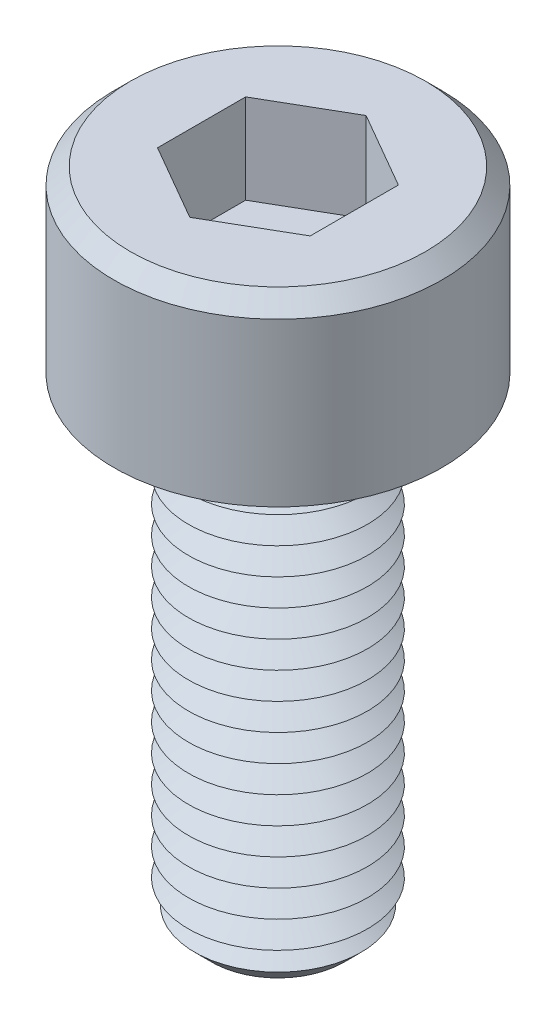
ISO-10303-21;
HEADER;
FILE_DESCRIPTION(('STEP AP214'),'2;1');
FILE_NAME('part.step','',(''),(''),'','','');
FILE_SCHEMA(('AUTOMOTIVE_DESIGN { 1 0 10303 214 1 1 1 1 }'));
ENDSEC;
DATA;
#1=APPLICATION_CONTEXT('core data for automotive mechanical design processes');
#2=APPLICATION_PROTOCOL_DEFINITION('international standard','automotive_design',2000,#1);
#3=PRODUCT_CONTEXT('',#1,'mechanical');
#4=PRODUCT('Part','Part','',(#3));
#5=PRODUCT_RELATED_PRODUCT_CATEGORY('part','',(#4));
#6=PRODUCT_DEFINITION_FORMATION('','',#4);
#7=PRODUCT_DEFINITION_CONTEXT('part definition',#1,'design');
#8=PRODUCT_DEFINITION('design','',#6,#7);
#9=PRODUCT_DEFINITION_SHAPE('','',#8);
#10=(LENGTH_UNIT() NAMED_UNIT(*) SI_UNIT(.MILLI.,.METRE.));
#11=(NAMED_UNIT(*) PLANE_ANGLE_UNIT() SI_UNIT($,.RADIAN.));
#12=(NAMED_UNIT(*) SI_UNIT($,.STERADIAN.) SOLID_ANGLE_UNIT());
#13=UNCERTAINTY_MEASURE_WITH_UNIT(LENGTH_MEASURE(1.E-05),#10,'distance_accuracy_value','');
#14=(GEOMETRIC_REPRESENTATION_CONTEXT(3) GLOBAL_UNCERTAINTY_ASSIGNED_CONTEXT((#13)) GLOBAL_UNIT_ASSIGNED_CONTEXT((#10,
#11,#12)) REPRESENTATION_CONTEXT('',''));
#15=CARTESIAN_POINT('',(0.,0.,0.));
#16=DIRECTION('',(0.,0.,1.));
#17=DIRECTION('',(1.,0.,0.));
#18=AXIS2_PLACEMENT_3D('',#15,#16,#17);
#19=CARTESIAN_POINT('',(0.,0.,0.));
#20=DIRECTION('',(0.,-1.,0.));
#21=DIRECTION('',(0.,0.,-1.00000000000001));
#22=AXIS2_PLACEMENT_3D('',#19,#20,#21);
#23=PLANE('',#22);
#24=CARTESIAN_POINT('',(0.,0.,0.));
#25=DIRECTION('',(0.,-1.,0.));
#26=DIRECTION('',(0.,0.,-1.00000000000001));
#27=AXIS2_PLACEMENT_3D('',#24,#25,#26);
#28=CIRCLE('',#27,1.5);
#29=CARTESIAN_POINT('',(0.,0.,-1.50000000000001));
#30=VERTEX_POINT('',#29);
#31=EDGE_CURVE('E11',#30,#30,#28,.T.);
#32=ORIENTED_EDGE('',*,*,#31,.F.);
#33=EDGE_LOOP('',(#32));
#34=FACE_BOUND('',#33,.T.);
#35=CARTESIAN_POINT('',(0.,0.,0.));
#36=DIRECTION('',(0.,-1.,0.));
#37=DIRECTION('',(0.,0.,-1.00000000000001));
#38=AXIS2_PLACEMENT_3D('',#35,#36,#37);
#39=CIRCLE('',#38,2.75);
#40=CARTESIAN_POINT('',(0.,0.,-2.75000000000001));
#41=VERTEX_POINT('',#40);
#42=EDGE_CURVE('E43',#41,#41,#39,.T.);
#43=ORIENTED_EDGE('',*,*,#42,.T.);
#44=EDGE_LOOP('',(#43));
#45=FACE_BOUND('',#44,.T.);
#46=ADVANCED_FACE('F36',(#34,#45),#23,.T.);
#47=CARTESIAN_POINT('',(0.,0.,0.));
#48=DIRECTION('',(0.,-1.,0.));
#49=DIRECTION('',(0.,0.,-1.00000000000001));
#50=AXIS2_PLACEMENT_3D('',#47,#48,#49);
#51=CYLINDRICAL_SURFACE('',#50,2.75);
#52=CARTESIAN_POINT('',(0.,2.725,0.));
#53=DIRECTION('',(0.,-1.,0.));
#54=DIRECTION('',(0.,0.,-1.00000000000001));
#55=AXIS2_PLACEMENT_3D('',#52,#53,#54);
#56=CIRCLE('',#55,2.75);
#57=CARTESIAN_POINT('',(0.,2.725,-2.75000000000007));
#58=VERTEX_POINT('',#57);
#59=EDGE_CURVE('E253',#58,#58,#56,.T.);
#60=ORIENTED_EDGE('',*,*,#59,.T.);
#61=EDGE_LOOP('',(#60));
#62=FACE_BOUND('',#61,.T.);
#63=ORIENTED_EDGE('',*,*,#42,.F.);
#64=EDGE_LOOP('',(#63));
#65=FACE_BOUND('',#64,.T.);
#66=ADVANCED_FACE('F259',(#62,#65),#51,.T.);
#67=CARTESIAN_POINT('',(0.,2.725,0.));
#68=DIRECTION('',(0.,-1.,0.));
#69=DIRECTION('',(0.,0.,-1.00000000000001));
#70=AXIS2_PLACEMENT_3D('',#67,#68,#69);
#71=CONICAL_SURFACE('',#70,2.75,0.785398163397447);
#72=CARTESIAN_POINT('',(0.,3.,0.));
#73=DIRECTION('',(0.,-1.,0.));
#74=DIRECTION('',(0.,0.,-1.00000000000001));
#75=AXIS2_PLACEMENT_3D('',#72,#73,#74);
#76=CIRCLE('',#75,2.475);
#77=CARTESIAN_POINT('',(0.,3.,-2.47500000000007));
#78=VERTEX_POINT('',#77);
#79=EDGE_CURVE('E250',#78,#78,#76,.T.);
#80=ORIENTED_EDGE('',*,*,#79,.T.);
#81=EDGE_LOOP('',(#80));
#82=FACE_BOUND('',#81,.T.);
#83=ORIENTED_EDGE('',*,*,#59,.F.);
#84=EDGE_LOOP('',(#83));
#85=FACE_BOUND('',#84,.T.);
#86=ADVANCED_FACE('F261',(#82,#85),#71,.T.);
#87=CARTESIAN_POINT('',(2.47500000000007,2.99999999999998,0.));
#88=DIRECTION('',(0.,1.,0.));
#89=DIRECTION('',(0.,0.,1.00000000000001));
#90=AXIS2_PLACEMENT_3D('',#87,#88,#89);
#91=PLANE('',#90);
#92=DIRECTION('',(1.02063357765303E-11,0.,1.00000000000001));
#93=VECTOR('',#92,1.);
#94=CARTESIAN_POINT('',(-1.28000000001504,2.99999999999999,-0.739008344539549));
#95=LINE('',#94,#93);
#96=CARTESIAN_POINT('',(-1.28000000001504,2.99999999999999,-0.739008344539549));
#97=VERTEX_POINT('',#96);
#98=CARTESIAN_POINT('',(-1.27999999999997,3.,0.739008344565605));
#99=VERTEX_POINT('',#98);
#100=EDGE_CURVE('E50',#97,#99,#95,.T.);
#101=ORIENTED_EDGE('',*,*,#100,.F.);
#102=DIRECTION('',(-0.866025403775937,0.,0.500000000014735));
#103=VECTOR('',#102,1.);
#104=CARTESIAN_POINT('',(-2.25930385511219E-11,2.99999999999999,-1.47801668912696));
#105=LINE('',#104,#103);
#106=CARTESIAN_POINT('',(-2.25930385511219E-11,2.99999999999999,-1.47801668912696));
#107=VERTEX_POINT('',#106);
#108=EDGE_CURVE('E133',#107,#97,#105,.T.);
#109=ORIENTED_EDGE('',*,*,#108,.F.);
#110=DIRECTION('',(-0.866025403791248,0.,-0.499999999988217));
#111=VECTOR('',#110,1.);
#112=CARTESIAN_POINT('',(1.27999999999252,3.,-0.73900834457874));
#113=LINE('',#112,#111);
#114=CARTESIAN_POINT('',(1.27999999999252,3.,-0.73900834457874));
#115=VERTEX_POINT('',#114);
#116=EDGE_CURVE('E131',#115,#107,#113,.T.);
#117=ORIENTED_EDGE('',*,*,#116,.F.);
#118=DIRECTION('',(-1.02068770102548E-11,0.,-1.00000000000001));
#119=VECTOR('',#118,1.);
#120=CARTESIAN_POINT('',(1.28000000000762,2.99999999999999,0.739008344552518));
#121=LINE('',#120,#119);
#122=CARTESIAN_POINT('',(1.28000000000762,2.99999999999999,0.739008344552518));
#123=VERTEX_POINT('',#122);
#124=EDGE_CURVE('E98',#123,#115,#121,.T.);
#125=ORIENTED_EDGE('',*,*,#124,.F.);
#126=DIRECTION('',(0.866025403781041,0.,-0.500000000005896));
#127=VECTOR('',#126,1.);
#128=CARTESIAN_POINT('',(7.60155827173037E-12,3.00000000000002,1.47801668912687));
#129=LINE('',#128,#127);
#130=CARTESIAN_POINT('',(7.60155827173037E-12,3.00000000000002,1.47801668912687));
#131=VERTEX_POINT('',#130);
#132=EDGE_CURVE('E127',#131,#123,#129,.T.);
#133=ORIENTED_EDGE('',*,*,#132,.F.);
#134=DIRECTION('',(0.866025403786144,0.,0.499999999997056));
#135=VECTOR('',#134,1.);
#136=CARTESIAN_POINT('',(-1.27999999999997,3.,0.739008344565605));
#137=LINE('',#136,#135);
#138=EDGE_CURVE('E124',#99,#131,#137,.T.);
#139=ORIENTED_EDGE('',*,*,#138,.F.);
#140=EDGE_LOOP('',(#101,#109,#117,#125,#133,#139));
#141=FACE_BOUND('',#140,.T.);
#142=ORIENTED_EDGE('',*,*,#79,.F.);
#143=EDGE_LOOP('',(#142));
#144=FACE_BOUND('',#143,.T.);
#145=ADVANCED_FACE('F267',(#141,#144),#91,.T.);
#146=CARTESIAN_POINT('',(0.,-8.00000000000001,0.));
#147=DIRECTION('',(0.,-1.,0.));
#148=DIRECTION('',(0.,0.,-1.00000000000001));
#149=AXIS2_PLACEMENT_3D('',#146,#147,#148);
#150=PLANE('',#149);
#151=CARTESIAN_POINT('',(0.,-8.00000000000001,0.));
#152=DIRECTION('',(0.,-1.,0.));
#153=DIRECTION('',(0.,0.,-1.00000000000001));
#154=AXIS2_PLACEMENT_3D('',#151,#152,#153);
#155=CIRCLE('',#154,1.1087025);
#156=CARTESIAN_POINT('',(0.,-8.00000000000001,-1.1087025));
#157=VERTEX_POINT('',#156);
#158=EDGE_CURVE('E247',#157,#157,#155,.T.);
#159=ORIENTED_EDGE('',*,*,#158,.T.);
#160=EDGE_LOOP('',(#159));
#161=FACE_BOUND('',#160,.T.);
#162=ADVANCED_FACE('F274',(#161),#150,.T.);
#163=CARTESIAN_POINT('',(0.,-8.00000000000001,0.));
#164=DIRECTION('',(0.,1.,0.));
#165=DIRECTION('',(0.,0.,1.00000000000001));
#166=AXIS2_PLACEMENT_3D('',#163,#164,#165);
#167=CONICAL_SURFACE('',#166,1.1087025,0.785398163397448);
#168=CARTESIAN_POINT('',(0.,-7.71308703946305,0.));
#169=DIRECTION('',(0.,-1.,0.));
#170=DIRECTION('',(0.,0.,-1.00000000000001));
#171=AXIS2_PLACEMENT_3D('',#168,#169,#170);
#172=CIRCLE('',#171,1.39561546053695);
#173=CARTESIAN_POINT('',(0.,-7.71308703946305,-1.39561546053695));
#174=VERTEX_POINT('',#173);
#175=EDGE_CURVE('E244',#174,#174,#172,.T.);
#176=ORIENTED_EDGE('',*,*,#175,.T.);
#177=EDGE_LOOP('',(#176));
#178=FACE_BOUND('',#177,.T.);
#179=ORIENTED_EDGE('',*,*,#158,.F.);
#180=EDGE_LOOP('',(#179));
#181=FACE_BOUND('',#180,.T.);
#182=ADVANCED_FACE('F278',(#178,#181),#167,.T.);
#183=CARTESIAN_POINT('',(0.,-7.71308703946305,0.));
#184=DIRECTION('',(0.,-1.,0.));
#185=DIRECTION('',(0.,0.,-1.00000000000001));
#186=AXIS2_PLACEMENT_3D('',#183,#184,#185);
#187=CONICAL_SURFACE('',#186,1.39561546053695,1.04910999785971);
#188=CARTESIAN_POINT('',(0.,-7.54816856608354,0.));
#189=DIRECTION('',(0.,-1.,0.));
#190=DIRECTION('',(0.,0.,-1.00000000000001));
#191=AXIS2_PLACEMENT_3D('',#188,#189,#190);
#192=CIRCLE('',#191,1.1087025);
#193=CARTESIAN_POINT('',(0.,-7.54816856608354,-1.10870250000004));
#194=VERTEX_POINT('',#193);
#195=EDGE_CURVE('E241',#194,#194,#192,.T.);
#196=ORIENTED_EDGE('',*,*,#195,.T.);
#197=EDGE_LOOP('',(#196));
#198=FACE_BOUND('',#197,.T.);
#199=ORIENTED_EDGE('',*,*,#175,.F.);
#200=EDGE_LOOP('',(#199));
#201=FACE_BOUND('',#200,.T.);
#202=ADVANCED_FACE('F282',(#198,#201),#187,.T.);
#203=CARTESIAN_POINT('',(0.,-7.54816856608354,0.));
#204=DIRECTION('',(0.,1.,0.));
#205=DIRECTION('',(0.,0.,1.00000000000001));
#206=AXIS2_PLACEMENT_3D('',#203,#204,#205);
#207=CONICAL_SURFACE('',#206,1.1087025,1.0471975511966);
#208=CARTESIAN_POINT('',(0.,-7.32225284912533,0.));
#209=DIRECTION('',(0.,-1.,0.));
#210=DIRECTION('',(0.,0.,-1.00000000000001));
#211=AXIS2_PLACEMENT_3D('',#208,#209,#210);
#212=CIRCLE('',#211,1.5);
#213=CARTESIAN_POINT('',(0.,-7.32225284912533,-1.50000000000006));
#214=VERTEX_POINT('',#213);
#215=EDGE_CURVE('E238',#214,#214,#212,.T.);
#216=ORIENTED_EDGE('',*,*,#215,.T.);
#217=EDGE_LOOP('',(#216));
#218=FACE_BOUND('',#217,.T.);
#219=ORIENTED_EDGE('',*,*,#195,.F.);
#220=EDGE_LOOP('',(#219));
#221=FACE_BOUND('',#220,.T.);
#222=ADVANCED_FACE('F286',(#218,#221),#207,.T.);
#223=CARTESIAN_POINT('',(0.,-7.32225284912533,0.));
#224=DIRECTION('',(0.,-1.,0.));
#225=DIRECTION('',(0.,0.,-1.00000000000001));
#226=AXIS2_PLACEMENT_3D('',#223,#224,#225);
#227=CONICAL_SURFACE('',#226,1.5,1.0471975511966);
#228=CARTESIAN_POINT('',(0.,-7.09633713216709,0.));
#229=DIRECTION('',(0.,-1.,0.));
#230=DIRECTION('',(0.,0.,-1.00000000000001));
#231=AXIS2_PLACEMENT_3D('',#228,#229,#230);
#232=CIRCLE('',#231,1.1087025);
#233=CARTESIAN_POINT('',(0.,-7.09633713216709,-1.10870250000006));
#234=VERTEX_POINT('',#233);
#235=EDGE_CURVE('E235',#234,#234,#232,.T.);
#236=ORIENTED_EDGE('',*,*,#235,.T.);
#237=EDGE_LOOP('',(#236));
#238=FACE_BOUND('',#237,.T.);
#239=ORIENTED_EDGE('',*,*,#215,.F.);
#240=EDGE_LOOP('',(#239));
#241=FACE_BOUND('',#240,.T.);
#242=ADVANCED_FACE('F290',(#238,#241),#227,.T.);
#243=CARTESIAN_POINT('',(0.,-7.09633713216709,0.));
#244=DIRECTION('',(0.,1.,0.));
#245=DIRECTION('',(0.,0.,1.00000000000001));
#246=AXIS2_PLACEMENT_3D('',#243,#244,#245);
#247=CONICAL_SURFACE('',#246,1.1087025,1.0471975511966);
#248=CARTESIAN_POINT('',(0.,-6.87042141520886,0.));
#249=DIRECTION('',(0.,-1.,0.));
#250=DIRECTION('',(0.,0.,-1.00000000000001));
#251=AXIS2_PLACEMENT_3D('',#248,#249,#250);
#252=CIRCLE('',#251,1.5);
#253=CARTESIAN_POINT('',(0.,-6.87042141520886,-1.50000000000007));
#254=VERTEX_POINT('',#253);
#255=EDGE_CURVE('E232',#254,#254,#252,.T.);
#256=ORIENTED_EDGE('',*,*,#255,.T.);
#257=EDGE_LOOP('',(#256));
#258=FACE_BOUND('',#257,.T.);
#259=ORIENTED_EDGE('',*,*,#235,.F.);
#260=EDGE_LOOP('',(#259));
#261=FACE_BOUND('',#260,.T.);
#262=ADVANCED_FACE('F294',(#258,#261),#247,.T.);
#263=CARTESIAN_POINT('',(0.,-6.87042141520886,0.));
#264=DIRECTION('',(0.,-1.,0.));
#265=DIRECTION('',(0.,0.,-1.00000000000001));
#266=AXIS2_PLACEMENT_3D('',#263,#264,#265);
#267=CONICAL_SURFACE('',#266,1.5,1.0471975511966);
#268=CARTESIAN_POINT('',(0.,-6.64450569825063,0.));
#269=DIRECTION('',(0.,-1.,0.));
#270=DIRECTION('',(0.,0.,-1.00000000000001));
#271=AXIS2_PLACEMENT_3D('',#268,#269,#270);
#272=CIRCLE('',#271,1.1087025);
#273=CARTESIAN_POINT('',(0.,-6.64450569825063,-1.10870250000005));
#274=VERTEX_POINT('',#273);
#275=EDGE_CURVE('E229',#274,#274,#272,.T.);
#276=ORIENTED_EDGE('',*,*,#275,.T.);
#277=EDGE_LOOP('',(#276));
#278=FACE_BOUND('',#277,.T.);
#279=ORIENTED_EDGE('',*,*,#255,.F.);
#280=EDGE_LOOP('',(#279));
#281=FACE_BOUND('',#280,.T.);
#282=ADVANCED_FACE('F298',(#278,#281),#267,.T.);
#283=CARTESIAN_POINT('',(0.,-6.64450569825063,0.));
#284=DIRECTION('',(0.,1.,0.));
#285=DIRECTION('',(0.,0.,1.00000000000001));
#286=AXIS2_PLACEMENT_3D('',#283,#284,#285);
#287=CONICAL_SURFACE('',#286,1.1087025,1.0471975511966);
#288=CARTESIAN_POINT('',(0.,-6.41858998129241,0.));
#289=DIRECTION('',(0.,-1.,0.));
#290=DIRECTION('',(0.,0.,-1.00000000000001));
#291=AXIS2_PLACEMENT_3D('',#288,#289,#290);
#292=CIRCLE('',#291,1.5);
#293=CARTESIAN_POINT('',(0.,-6.41858998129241,-1.50000000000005));
#294=VERTEX_POINT('',#293);
#295=EDGE_CURVE('E226',#294,#294,#292,.T.);
#296=ORIENTED_EDGE('',*,*,#295,.T.);
#297=EDGE_LOOP('',(#296));
#298=FACE_BOUND('',#297,.T.);
#299=ORIENTED_EDGE('',*,*,#275,.F.);
#300=EDGE_LOOP('',(#299));
#301=FACE_BOUND('',#300,.T.);
#302=ADVANCED_FACE('F302',(#298,#301),#287,.T.);
#303=CARTESIAN_POINT('',(0.,-6.41858998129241,0.));
#304=DIRECTION('',(0.,-1.,0.));
#305=DIRECTION('',(0.,0.,-1.00000000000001));
#306=AXIS2_PLACEMENT_3D('',#303,#304,#305);
#307=CONICAL_SURFACE('',#306,1.5,1.0471975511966);
#308=CARTESIAN_POINT('',(0.,-6.19267426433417,0.));
#309=DIRECTION('',(0.,-1.,0.));
#310=DIRECTION('',(0.,0.,-1.00000000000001));
#311=AXIS2_PLACEMENT_3D('',#308,#309,#310);
#312=CIRCLE('',#311,1.1087025);
#313=CARTESIAN_POINT('',(0.,-6.19267426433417,-1.10870250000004));
#314=VERTEX_POINT('',#313);
#315=EDGE_CURVE('E223',#314,#314,#312,.T.);
#316=ORIENTED_EDGE('',*,*,#315,.T.);
#317=EDGE_LOOP('',(#316));
#318=FACE_BOUND('',#317,.T.);
#319=ORIENTED_EDGE('',*,*,#295,.F.);
#320=EDGE_LOOP('',(#319));
#321=FACE_BOUND('',#320,.T.);
#322=ADVANCED_FACE('F306',(#318,#321),#307,.T.);
#323=CARTESIAN_POINT('',(0.,-6.19267426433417,0.));
#324=DIRECTION('',(0.,1.,0.));
#325=DIRECTION('',(0.,0.,1.00000000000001));
#326=AXIS2_PLACEMENT_3D('',#323,#324,#325);
#327=CONICAL_SURFACE('',#326,1.1087025,1.0471975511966);
#328=CARTESIAN_POINT('',(0.,-5.96675854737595,0.));
#329=DIRECTION('',(0.,-1.,0.));
#330=DIRECTION('',(0.,0.,-1.00000000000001));
#331=AXIS2_PLACEMENT_3D('',#328,#329,#330);
#332=CIRCLE('',#331,1.5);
#333=CARTESIAN_POINT('',(0.,-5.96675854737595,-1.50000000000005));
#334=VERTEX_POINT('',#333);
#335=EDGE_CURVE('E220',#334,#334,#332,.T.);
#336=ORIENTED_EDGE('',*,*,#335,.T.);
#337=EDGE_LOOP('',(#336));
#338=FACE_BOUND('',#337,.T.);
#339=ORIENTED_EDGE('',*,*,#315,.F.);
#340=EDGE_LOOP('',(#339));
#341=FACE_BOUND('',#340,.T.);
#342=ADVANCED_FACE('F310',(#338,#341),#327,.T.);
#343=CARTESIAN_POINT('',(0.,-5.96675854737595,0.));
#344=DIRECTION('',(0.,-1.,0.));
#345=DIRECTION('',(0.,0.,-1.00000000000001));
#346=AXIS2_PLACEMENT_3D('',#343,#344,#345);
#347=CONICAL_SURFACE('',#346,1.5,1.0471975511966);
#348=CARTESIAN_POINT('',(0.,-5.74084283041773,0.));
#349=DIRECTION('',(0.,-1.,0.));
#350=DIRECTION('',(0.,0.,-1.00000000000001));
#351=AXIS2_PLACEMENT_3D('',#348,#349,#350);
#352=CIRCLE('',#351,1.1087025);
#353=CARTESIAN_POINT('',(0.,-5.74084283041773,-1.10870250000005));
#354=VERTEX_POINT('',#353);
#355=EDGE_CURVE('E217',#354,#354,#352,.T.);
#356=ORIENTED_EDGE('',*,*,#355,.T.);
#357=EDGE_LOOP('',(#356));
#358=FACE_BOUND('',#357,.T.);
#359=ORIENTED_EDGE('',*,*,#335,.F.);
#360=EDGE_LOOP('',(#359));
#361=FACE_BOUND('',#360,.T.);
#362=ADVANCED_FACE('F314',(#358,#361),#347,.T.);
#363=CARTESIAN_POINT('',(0.,-5.74084283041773,0.));
#364=DIRECTION('',(0.,1.,0.));
#365=DIRECTION('',(0.,0.,1.00000000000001));
#366=AXIS2_PLACEMENT_3D('',#363,#364,#365);
#367=CONICAL_SURFACE('',#366,1.1087025,1.0471975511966);
#368=CARTESIAN_POINT('',(0.,-5.51492711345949,0.));
#369=DIRECTION('',(0.,-1.,0.));
#370=DIRECTION('',(0.,0.,-1.00000000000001));
#371=AXIS2_PLACEMENT_3D('',#368,#369,#370);
#372=CIRCLE('',#371,1.5);
#373=CARTESIAN_POINT('',(0.,-5.51492711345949,-1.50000000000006));
#374=VERTEX_POINT('',#373);
#375=EDGE_CURVE('E214',#374,#374,#372,.T.);
#376=ORIENTED_EDGE('',*,*,#375,.T.);
#377=EDGE_LOOP('',(#376));
#378=FACE_BOUND('',#377,.T.);
#379=ORIENTED_EDGE('',*,*,#355,.F.);
#380=EDGE_LOOP('',(#379));
#381=FACE_BOUND('',#380,.T.);
#382=ADVANCED_FACE('F318',(#378,#381),#367,.T.);
#383=CARTESIAN_POINT('',(0.,-5.51492711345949,0.));
#384=DIRECTION('',(0.,-1.,0.));
#385=DIRECTION('',(0.,0.,-1.00000000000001));
#386=AXIS2_PLACEMENT_3D('',#383,#384,#385);
#387=CONICAL_SURFACE('',#386,1.5,1.0471975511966);
#388=CARTESIAN_POINT('',(0.,-5.28901139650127,-1.04083408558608E-13));
#389=DIRECTION('',(0.,-1.,0.));
#390=DIRECTION('',(0.,0.,-1.00000000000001));
#391=AXIS2_PLACEMENT_3D('',#388,#389,#390);
#392=CIRCLE('',#391,1.1087025);
#393=CARTESIAN_POINT('',(0.,-5.28901139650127,-1.10870250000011));
#394=VERTEX_POINT('',#393);
#395=EDGE_CURVE('E211',#394,#394,#392,.T.);
#396=ORIENTED_EDGE('',*,*,#395,.T.);
#397=EDGE_LOOP('',(#396));
#398=FACE_BOUND('',#397,.T.);
#399=ORIENTED_EDGE('',*,*,#375,.F.);
#400=EDGE_LOOP('',(#399));
#401=FACE_BOUND('',#400,.T.);
#402=ADVANCED_FACE('F322',(#398,#401),#387,.T.);
#403=CARTESIAN_POINT('',(0.,-5.28901139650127,-1.04083408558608E-13));
#404=DIRECTION('',(0.,1.,0.));
#405=DIRECTION('',(0.,0.,1.00000000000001));
#406=AXIS2_PLACEMENT_3D('',#403,#404,#405);
#407=CONICAL_SURFACE('',#406,1.1087025,1.0471975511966);
#408=CARTESIAN_POINT('',(0.,-5.06309567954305,0.));
#409=DIRECTION('',(0.,-1.,0.));
#410=DIRECTION('',(0.,0.,-1.00000000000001));
#411=AXIS2_PLACEMENT_3D('',#408,#409,#410);
#412=CIRCLE('',#411,1.5);
#413=CARTESIAN_POINT('',(0.,-5.06309567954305,-1.50000000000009));
#414=VERTEX_POINT('',#413);
#415=EDGE_CURVE('E208',#414,#414,#412,.T.);
#416=ORIENTED_EDGE('',*,*,#415,.T.);
#417=EDGE_LOOP('',(#416));
#418=FACE_BOUND('',#417,.T.);
#419=ORIENTED_EDGE('',*,*,#395,.F.);
#420=EDGE_LOOP('',(#419));
#421=FACE_BOUND('',#420,.T.);
#422=ADVANCED_FACE('F326',(#418,#421),#407,.T.);
#423=CARTESIAN_POINT('',(0.,-5.06309567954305,0.));
#424=DIRECTION('',(0.,-1.,0.));
#425=DIRECTION('',(0.,0.,-1.00000000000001));
#426=AXIS2_PLACEMENT_3D('',#423,#424,#425);
#427=CONICAL_SURFACE('',#426,1.5,1.0471975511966);
#428=CARTESIAN_POINT('',(0.,-4.83717996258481,0.));
#429=DIRECTION('',(0.,-1.,0.));
#430=DIRECTION('',(0.,0.,-1.00000000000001));
#431=AXIS2_PLACEMENT_3D('',#428,#429,#430);
#432=CIRCLE('',#431,1.1087025);
#433=CARTESIAN_POINT('',(0.,-4.83717996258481,-1.10870250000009));
#434=VERTEX_POINT('',#433);
#435=EDGE_CURVE('E205',#434,#434,#432,.T.);
#436=ORIENTED_EDGE('',*,*,#435,.T.);
#437=EDGE_LOOP('',(#436));
#438=FACE_BOUND('',#437,.T.);
#439=ORIENTED_EDGE('',*,*,#415,.F.);
#440=EDGE_LOOP('',(#439));
#441=FACE_BOUND('',#440,.T.);
#442=ADVANCED_FACE('F330',(#438,#441),#427,.T.);
#443=CARTESIAN_POINT('',(0.,-4.83717996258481,0.));
#444=DIRECTION('',(0.,1.,0.));
#445=DIRECTION('',(0.,0.,1.00000000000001));
#446=AXIS2_PLACEMENT_3D('',#443,#444,#445);
#447=CONICAL_SURFACE('',#446,1.1087025,1.0471975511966);
#448=CARTESIAN_POINT('',(0.,-4.61126424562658,0.));
#449=DIRECTION('',(0.,-1.,0.));
#450=DIRECTION('',(0.,0.,-1.00000000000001));
#451=AXIS2_PLACEMENT_3D('',#448,#449,#450);
#452=CIRCLE('',#451,1.5);
#453=CARTESIAN_POINT('',(0.,-4.61126424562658,-1.5000000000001));
#454=VERTEX_POINT('',#453);
#455=EDGE_CURVE('E202',#454,#454,#452,.T.);
#456=ORIENTED_EDGE('',*,*,#455,.T.);
#457=EDGE_LOOP('',(#456));
#458=FACE_BOUND('',#457,.T.);
#459=ORIENTED_EDGE('',*,*,#435,.F.);
#460=EDGE_LOOP('',(#459));
#461=FACE_BOUND('',#460,.T.);
#462=ADVANCED_FACE('F334',(#458,#461),#447,.T.);
#463=CARTESIAN_POINT('',(0.,-4.61126424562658,0.));
#464=DIRECTION('',(0.,-1.,0.));
#465=DIRECTION('',(0.,0.,-1.00000000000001));
#466=AXIS2_PLACEMENT_3D('',#463,#464,#465);
#467=CONICAL_SURFACE('',#466,1.5,1.0471975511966);
#468=CARTESIAN_POINT('',(0.,-4.38534852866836,0.));
#469=DIRECTION('',(0.,-1.,0.));
#470=DIRECTION('',(0.,0.,-1.00000000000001));
#471=AXIS2_PLACEMENT_3D('',#468,#469,#470);
#472=CIRCLE('',#471,1.1087025);
#473=CARTESIAN_POINT('',(0.,-4.38534852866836,-1.1087025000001));
#474=VERTEX_POINT('',#473);
#475=EDGE_CURVE('E199',#474,#474,#472,.T.);
#476=ORIENTED_EDGE('',*,*,#475,.T.);
#477=EDGE_LOOP('',(#476));
#478=FACE_BOUND('',#477,.T.);
#479=ORIENTED_EDGE('',*,*,#455,.F.);
#480=EDGE_LOOP('',(#479));
#481=FACE_BOUND('',#480,.T.);
#482=ADVANCED_FACE('F338',(#478,#481),#467,.T.);
#483=CARTESIAN_POINT('',(0.,-4.38534852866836,0.));
#484=DIRECTION('',(0.,1.,0.));
#485=DIRECTION('',(0.,0.,1.00000000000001));
#486=AXIS2_PLACEMENT_3D('',#483,#484,#485);
#487=CONICAL_SURFACE('',#486,1.1087025,1.0471975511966);
#488=CARTESIAN_POINT('',(0.,-4.15943281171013,0.));
#489=DIRECTION('',(0.,-1.,0.));
#490=DIRECTION('',(0.,0.,-1.00000000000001));
#491=AXIS2_PLACEMENT_3D('',#488,#489,#490);
#492=CIRCLE('',#491,1.5);
#493=CARTESIAN_POINT('',(0.,-4.15943281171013,-1.50000000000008));
#494=VERTEX_POINT('',#493);
#495=EDGE_CURVE('E196',#494,#494,#492,.T.);
#496=ORIENTED_EDGE('',*,*,#495,.T.);
#497=EDGE_LOOP('',(#496));
#498=FACE_BOUND('',#497,.T.);
#499=ORIENTED_EDGE('',*,*,#475,.F.);
#500=EDGE_LOOP('',(#499));
#501=FACE_BOUND('',#500,.T.);
#502=ADVANCED_FACE('F342',(#498,#501),#487,.T.);
#503=CARTESIAN_POINT('',(0.,-4.15943281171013,0.));
#504=DIRECTION('',(0.,-1.,0.));
#505=DIRECTION('',(0.,0.,-1.00000000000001));
#506=AXIS2_PLACEMENT_3D('',#503,#504,#505);
#507=CONICAL_SURFACE('',#506,1.5,1.0471975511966);
#508=CARTESIAN_POINT('',(0.,-3.9335170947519,0.));
#509=DIRECTION('',(0.,-1.,0.));
#510=DIRECTION('',(0.,0.,-1.00000000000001));
#511=AXIS2_PLACEMENT_3D('',#508,#509,#510);
#512=CIRCLE('',#511,1.1087025);
#513=CARTESIAN_POINT('',(0.,-3.9335170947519,-1.10870250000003));
#514=VERTEX_POINT('',#513);
#515=EDGE_CURVE('E193',#514,#514,#512,.T.);
#516=ORIENTED_EDGE('',*,*,#515,.T.);
#517=EDGE_LOOP('',(#516));
#518=FACE_BOUND('',#517,.T.);
#519=ORIENTED_EDGE('',*,*,#495,.F.);
#520=EDGE_LOOP('',(#519));
#521=FACE_BOUND('',#520,.T.);
#522=ADVANCED_FACE('F346',(#518,#521),#507,.T.);
#523=CARTESIAN_POINT('',(0.,-3.9335170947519,0.));
#524=DIRECTION('',(0.,1.,0.));
#525=DIRECTION('',(0.,0.,1.00000000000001));
#526=AXIS2_PLACEMENT_3D('',#523,#524,#525);
#527=CONICAL_SURFACE('',#526,1.1087025,1.0471975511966);
#528=CARTESIAN_POINT('',(0.,-3.70760137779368,0.));
#529=DIRECTION('',(0.,-1.,0.));
#530=DIRECTION('',(0.,0.,-1.00000000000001));
#531=AXIS2_PLACEMENT_3D('',#528,#529,#530);
#532=CIRCLE('',#531,1.5);
#533=CARTESIAN_POINT('',(0.,-3.70760137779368,-1.50000000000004));
#534=VERTEX_POINT('',#533);
#535=EDGE_CURVE('E190',#534,#534,#532,.T.);
#536=ORIENTED_EDGE('',*,*,#535,.T.);
#537=EDGE_LOOP('',(#536));
#538=FACE_BOUND('',#537,.T.);
#539=ORIENTED_EDGE('',*,*,#515,.F.);
#540=EDGE_LOOP('',(#539));
#541=FACE_BOUND('',#540,.T.);
#542=ADVANCED_FACE('F350',(#538,#541),#527,.T.);
#543=CARTESIAN_POINT('',(0.,-3.70760137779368,0.));
#544=DIRECTION('',(0.,-1.,0.));
#545=DIRECTION('',(0.,0.,-1.00000000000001));
#546=AXIS2_PLACEMENT_3D('',#543,#544,#545);
#547=CONICAL_SURFACE('',#546,1.5,1.0471975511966);
#548=CARTESIAN_POINT('',(0.,-3.48168566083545,0.));
#549=DIRECTION('',(0.,-1.,0.));
#550=DIRECTION('',(0.,0.,-1.00000000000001));
#551=AXIS2_PLACEMENT_3D('',#548,#549,#550);
#552=CIRCLE('',#551,1.1087025);
#553=CARTESIAN_POINT('',(0.,-3.48168566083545,-1.10870250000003));
#554=VERTEX_POINT('',#553);
#555=EDGE_CURVE('E187',#554,#554,#552,.T.);
#556=ORIENTED_EDGE('',*,*,#555,.T.);
#557=EDGE_LOOP('',(#556));
#558=FACE_BOUND('',#557,.T.);
#559=ORIENTED_EDGE('',*,*,#535,.F.);
#560=EDGE_LOOP('',(#559));
#561=FACE_BOUND('',#560,.T.);
#562=ADVANCED_FACE('F354',(#558,#561),#547,.T.);
#563=CARTESIAN_POINT('',(0.,-3.48168566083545,0.));
#564=DIRECTION('',(0.,1.,0.));
#565=DIRECTION('',(0.,0.,1.00000000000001));
#566=AXIS2_PLACEMENT_3D('',#563,#564,#565);
#567=CONICAL_SURFACE('',#566,1.1087025,1.0471975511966);
#568=CARTESIAN_POINT('',(0.,-3.25576994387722,0.));
#569=DIRECTION('',(0.,-1.,0.));
#570=DIRECTION('',(0.,0.,-1.00000000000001));
#571=AXIS2_PLACEMENT_3D('',#568,#569,#570);
#572=CIRCLE('',#571,1.5);
#573=CARTESIAN_POINT('',(0.,-3.25576994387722,-1.50000000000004));
#574=VERTEX_POINT('',#573);
#575=EDGE_CURVE('E184',#574,#574,#572,.T.);
#576=ORIENTED_EDGE('',*,*,#575,.T.);
#577=EDGE_LOOP('',(#576));
#578=FACE_BOUND('',#577,.T.);
#579=ORIENTED_EDGE('',*,*,#555,.F.);
#580=EDGE_LOOP('',(#579));
#581=FACE_BOUND('',#580,.T.);
#582=ADVANCED_FACE('F358',(#578,#581),#567,.T.);
#583=CARTESIAN_POINT('',(0.,-3.25576994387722,0.));
#584=DIRECTION('',(0.,-1.,0.));
#585=DIRECTION('',(0.,0.,-1.00000000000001));
#586=AXIS2_PLACEMENT_3D('',#583,#584,#585);
#587=CONICAL_SURFACE('',#586,1.5,1.0471975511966);
#588=CARTESIAN_POINT('',(0.,-3.029854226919,0.));
#589=DIRECTION('',(0.,-1.,0.));
#590=DIRECTION('',(0.,0.,-1.00000000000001));
#591=AXIS2_PLACEMENT_3D('',#588,#589,#590);
#592=CIRCLE('',#591,1.1087025);
#593=CARTESIAN_POINT('',(0.,-3.029854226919,-1.10870250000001));
#594=VERTEX_POINT('',#593);
#595=EDGE_CURVE('E181',#594,#594,#592,.T.);
#596=ORIENTED_EDGE('',*,*,#595,.T.);
#597=EDGE_LOOP('',(#596));
#598=FACE_BOUND('',#597,.T.);
#599=ORIENTED_EDGE('',*,*,#575,.F.);
#600=EDGE_LOOP('',(#599));
#601=FACE_BOUND('',#600,.T.);
#602=ADVANCED_FACE('F362',(#598,#601),#587,.T.);
#603=CARTESIAN_POINT('',(0.,-3.029854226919,0.));
#604=DIRECTION('',(0.,1.,0.));
#605=DIRECTION('',(0.,0.,1.00000000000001));
#606=AXIS2_PLACEMENT_3D('',#603,#604,#605);
#607=CONICAL_SURFACE('',#606,1.1087025,1.0471975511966);
#608=CARTESIAN_POINT('',(0.,-2.80393850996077,0.));
#609=DIRECTION('',(0.,-1.,0.));
#610=DIRECTION('',(0.,0.,-1.00000000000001));
#611=AXIS2_PLACEMENT_3D('',#608,#609,#610);
#612=CIRCLE('',#611,1.5);
#613=CARTESIAN_POINT('',(0.,-2.80393850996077,-1.50000000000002));
#614=VERTEX_POINT('',#613);
#615=EDGE_CURVE('E178',#614,#614,#612,.T.);
#616=ORIENTED_EDGE('',*,*,#615,.T.);
#617=EDGE_LOOP('',(#616));
#618=FACE_BOUND('',#617,.T.);
#619=ORIENTED_EDGE('',*,*,#595,.F.);
#620=EDGE_LOOP('',(#619));
#621=FACE_BOUND('',#620,.T.);
#622=ADVANCED_FACE('F366',(#618,#621),#607,.T.);
#623=CARTESIAN_POINT('',(0.,-2.80393850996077,0.));
#624=DIRECTION('',(0.,-1.,0.));
#625=DIRECTION('',(0.,0.,-1.00000000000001));
#626=AXIS2_PLACEMENT_3D('',#623,#624,#625);
#627=CONICAL_SURFACE('',#626,1.5,1.0471975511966);
#628=CARTESIAN_POINT('',(0.,-2.57802279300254,0.));
#629=DIRECTION('',(0.,-1.,0.));
#630=DIRECTION('',(0.,0.,-1.00000000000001));
#631=AXIS2_PLACEMENT_3D('',#628,#629,#630);
#632=CIRCLE('',#631,1.1087025);
#633=CARTESIAN_POINT('',(0.,-2.57802279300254,-1.10870250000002));
#634=VERTEX_POINT('',#633);
#635=EDGE_CURVE('E175',#634,#634,#632,.T.);
#636=ORIENTED_EDGE('',*,*,#635,.T.);
#637=EDGE_LOOP('',(#636));
#638=FACE_BOUND('',#637,.T.);
#639=ORIENTED_EDGE('',*,*,#615,.F.);
#640=EDGE_LOOP('',(#639));
#641=FACE_BOUND('',#640,.T.);
#642=ADVANCED_FACE('F370',(#638,#641),#627,.T.);
#643=CARTESIAN_POINT('',(0.,-2.57802279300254,0.));
#644=DIRECTION('',(0.,1.,0.));
#645=DIRECTION('',(0.,0.,1.00000000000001));
#646=AXIS2_PLACEMENT_3D('',#643,#644,#645);
#647=CONICAL_SURFACE('',#646,1.1087025,1.0471975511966);
#648=CARTESIAN_POINT('',(0.,-2.3521070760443,0.));
#649=DIRECTION('',(0.,-1.,0.));
#650=DIRECTION('',(0.,0.,-1.00000000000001));
#651=AXIS2_PLACEMENT_3D('',#648,#649,#650);
#652=CIRCLE('',#651,1.5);
#653=CARTESIAN_POINT('',(0.,-2.3521070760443,-1.50000000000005));
#654=VERTEX_POINT('',#653);
#655=EDGE_CURVE('E172',#654,#654,#652,.T.);
#656=ORIENTED_EDGE('',*,*,#655,.T.);
#657=EDGE_LOOP('',(#656));
#658=FACE_BOUND('',#657,.T.);
#659=ORIENTED_EDGE('',*,*,#635,.F.);
#660=EDGE_LOOP('',(#659));
#661=FACE_BOUND('',#660,.T.);
#662=ADVANCED_FACE('F374',(#658,#661),#647,.T.);
#663=CARTESIAN_POINT('',(0.,-2.3521070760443,0.));
#664=DIRECTION('',(0.,-1.,0.));
#665=DIRECTION('',(0.,0.,-1.00000000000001));
#666=AXIS2_PLACEMENT_3D('',#663,#664,#665);
#667=CONICAL_SURFACE('',#666,1.5,1.0471975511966);
#668=CARTESIAN_POINT('',(0.,-2.12619135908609,0.));
#669=DIRECTION('',(0.,-1.,0.));
#670=DIRECTION('',(0.,0.,-1.00000000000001));
#671=AXIS2_PLACEMENT_3D('',#668,#669,#670);
#672=CIRCLE('',#671,1.1087025);
#673=CARTESIAN_POINT('',(0.,-2.12619135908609,-1.10870250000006));
#674=VERTEX_POINT('',#673);
#675=EDGE_CURVE('E169',#674,#674,#672,.T.);
#676=ORIENTED_EDGE('',*,*,#675,.T.);
#677=EDGE_LOOP('',(#676));
#678=FACE_BOUND('',#677,.T.);
#679=ORIENTED_EDGE('',*,*,#655,.F.);
#680=EDGE_LOOP('',(#679));
#681=FACE_BOUND('',#680,.T.);
#682=ADVANCED_FACE('F378',(#678,#681),#667,.T.);
#683=CARTESIAN_POINT('',(0.,-2.12619135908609,0.));
#684=DIRECTION('',(0.,1.,0.));
#685=DIRECTION('',(0.,0.,1.00000000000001));
#686=AXIS2_PLACEMENT_3D('',#683,#684,#685);
#687=CONICAL_SURFACE('',#686,1.1087025,1.0471975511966);
#688=CARTESIAN_POINT('',(0.,-1.90027564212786,0.));
#689=DIRECTION('',(0.,-1.,0.));
#690=DIRECTION('',(0.,0.,-1.00000000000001));
#691=AXIS2_PLACEMENT_3D('',#688,#689,#690);
#692=CIRCLE('',#691,1.5);
#693=CARTESIAN_POINT('',(0.,-1.90027564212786,-1.50000000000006));
#694=VERTEX_POINT('',#693);
#695=EDGE_CURVE('E166',#694,#694,#692,.T.);
#696=ORIENTED_EDGE('',*,*,#695,.T.);
#697=EDGE_LOOP('',(#696));
#698=FACE_BOUND('',#697,.T.);
#699=ORIENTED_EDGE('',*,*,#675,.F.);
#700=EDGE_LOOP('',(#699));
#701=FACE_BOUND('',#700,.T.);
#702=ADVANCED_FACE('F382',(#698,#701),#687,.T.);
#703=CARTESIAN_POINT('',(0.,-1.90027564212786,0.));
#704=DIRECTION('',(0.,-1.,0.));
#705=DIRECTION('',(0.,0.,-1.00000000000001));
#706=AXIS2_PLACEMENT_3D('',#703,#704,#705);
#707=CONICAL_SURFACE('',#706,1.5,1.0471975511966);
#708=CARTESIAN_POINT('',(0.,-1.67435992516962,0.));
#709=DIRECTION('',(0.,-1.,0.));
#710=DIRECTION('',(0.,0.,-1.00000000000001));
#711=AXIS2_PLACEMENT_3D('',#708,#709,#710);
#712=CIRCLE('',#711,1.1087025);
#713=CARTESIAN_POINT('',(0.,-1.67435992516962,-1.10870250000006));
#714=VERTEX_POINT('',#713);
#715=EDGE_CURVE('E163',#714,#714,#712,.T.);
#716=ORIENTED_EDGE('',*,*,#715,.T.);
#717=EDGE_LOOP('',(#716));
#718=FACE_BOUND('',#717,.T.);
#719=ORIENTED_EDGE('',*,*,#695,.F.);
#720=EDGE_LOOP('',(#719));
#721=FACE_BOUND('',#720,.T.);
#722=ADVANCED_FACE('F386',(#718,#721),#707,.T.);
#723=CARTESIAN_POINT('',(0.,-1.67435992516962,0.));
#724=DIRECTION('',(0.,1.,0.));
#725=DIRECTION('',(0.,0.,1.00000000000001));
#726=AXIS2_PLACEMENT_3D('',#723,#724,#725);
#727=CONICAL_SURFACE('',#726,1.1087025,1.0471975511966);
#728=CARTESIAN_POINT('',(0.,-1.4484442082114,0.));
#729=DIRECTION('',(0.,-1.,0.));
#730=DIRECTION('',(0.,0.,-1.00000000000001));
#731=AXIS2_PLACEMENT_3D('',#728,#729,#730);
#732=CIRCLE('',#731,1.5);
#733=CARTESIAN_POINT('',(0.,-1.4484442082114,-1.50000000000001));
#734=VERTEX_POINT('',#733);
#735=EDGE_CURVE('E160',#734,#734,#732,.T.);
#736=ORIENTED_EDGE('',*,*,#735,.T.);
#737=EDGE_LOOP('',(#736));
#738=FACE_BOUND('',#737,.T.);
#739=ORIENTED_EDGE('',*,*,#715,.F.);
#740=EDGE_LOOP('',(#739));
#741=FACE_BOUND('',#740,.T.);
#742=ADVANCED_FACE('F390',(#738,#741),#727,.T.);
#743=CARTESIAN_POINT('',(0.,-1.4484442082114,0.));
#744=DIRECTION('',(0.,-1.,0.));
#745=DIRECTION('',(0.,0.,-1.00000000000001));
#746=AXIS2_PLACEMENT_3D('',#743,#744,#745);
#747=CONICAL_SURFACE('',#746,1.5,1.0471975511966);
#748=CARTESIAN_POINT('',(0.,-1.22252849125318,0.));
#749=DIRECTION('',(0.,-1.,0.));
#750=DIRECTION('',(0.,0.,-1.00000000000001));
#751=AXIS2_PLACEMENT_3D('',#748,#749,#750);
#752=CIRCLE('',#751,1.1087025);
#753=CARTESIAN_POINT('',(0.,-1.22252849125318,-1.10870250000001));
#754=VERTEX_POINT('',#753);
#755=EDGE_CURVE('E157',#754,#754,#752,.T.);
#756=ORIENTED_EDGE('',*,*,#755,.T.);
#757=EDGE_LOOP('',(#756));
#758=FACE_BOUND('',#757,.T.);
#759=ORIENTED_EDGE('',*,*,#735,.F.);
#760=EDGE_LOOP('',(#759));
#761=FACE_BOUND('',#760,.T.);
#762=ADVANCED_FACE('F394',(#758,#761),#747,.T.);
#763=CARTESIAN_POINT('',(0.,-1.22252849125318,0.));
#764=DIRECTION('',(0.,1.,0.));
#765=DIRECTION('',(0.,0.,1.00000000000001));
#766=AXIS2_PLACEMENT_3D('',#763,#764,#765);
#767=CONICAL_SURFACE('',#766,1.1087025,1.0471975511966);
#768=CARTESIAN_POINT('',(0.,-0.996612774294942,0.));
#769=DIRECTION('',(0.,-1.,0.));
#770=DIRECTION('',(0.,0.,-1.00000000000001));
#771=AXIS2_PLACEMENT_3D('',#768,#769,#770);
#772=CIRCLE('',#771,1.5);
#773=CARTESIAN_POINT('',(0.,-0.996612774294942,-1.50000000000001));
#774=VERTEX_POINT('',#773);
#775=EDGE_CURVE('E154',#774,#774,#772,.T.);
#776=ORIENTED_EDGE('',*,*,#775,.T.);
#777=EDGE_LOOP('',(#776));
#778=FACE_BOUND('',#777,.T.);
#779=ORIENTED_EDGE('',*,*,#755,.F.);
#780=EDGE_LOOP('',(#779));
#781=FACE_BOUND('',#780,.T.);
#782=ADVANCED_FACE('F398',(#778,#781),#767,.T.);
#783=CARTESIAN_POINT('',(0.,-0.996612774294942,0.));
#784=DIRECTION('',(0.,-1.,0.));
#785=DIRECTION('',(0.,0.,-1.00000000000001));
#786=AXIS2_PLACEMENT_3D('',#783,#784,#785);
#787=CONICAL_SURFACE('',#786,1.5,1.0471975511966);
#788=CARTESIAN_POINT('',(0.,-0.770697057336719,0.));
#789=DIRECTION('',(0.,-1.,0.));
#790=DIRECTION('',(0.,0.,-1.00000000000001));
#791=AXIS2_PLACEMENT_3D('',#788,#789,#790);
#792=CIRCLE('',#791,1.1087025);
#793=CARTESIAN_POINT('',(0.,-0.770697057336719,-1.10870250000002));
#794=VERTEX_POINT('',#793);
#795=EDGE_CURVE('E151',#794,#794,#792,.T.);
#796=ORIENTED_EDGE('',*,*,#795,.T.);
#797=EDGE_LOOP('',(#796));
#798=FACE_BOUND('',#797,.T.);
#799=ORIENTED_EDGE('',*,*,#775,.F.);
#800=EDGE_LOOP('',(#799));
#801=FACE_BOUND('',#800,.T.);
#802=ADVANCED_FACE('F402',(#798,#801),#787,.T.);
#803=CARTESIAN_POINT('',(0.,-0.770697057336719,0.));
#804=DIRECTION('',(0.,1.,0.));
#805=DIRECTION('',(0.,0.,1.00000000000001));
#806=AXIS2_PLACEMENT_3D('',#803,#804,#805);
#807=CONICAL_SURFACE('',#806,1.1087025,1.0471975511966);
#808=CARTESIAN_POINT('',(0.,-0.544781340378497,0.));
#809=DIRECTION('',(0.,-1.,0.));
#810=DIRECTION('',(0.,0.,-1.00000000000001));
#811=AXIS2_PLACEMENT_3D('',#808,#809,#810);
#812=CIRCLE('',#811,1.5);
#813=CARTESIAN_POINT('',(0.,-0.544781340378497,-1.50000000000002));
#814=VERTEX_POINT('',#813);
#815=EDGE_CURVE('E148',#814,#814,#812,.T.);
#816=ORIENTED_EDGE('',*,*,#815,.T.);
#817=EDGE_LOOP('',(#816));
#818=FACE_BOUND('',#817,.T.);
#819=ORIENTED_EDGE('',*,*,#795,.F.);
#820=EDGE_LOOP('',(#819));
#821=FACE_BOUND('',#820,.T.);
#822=ADVANCED_FACE('F406',(#818,#821),#807,.T.);
#823=CARTESIAN_POINT('',(0.,-0.544781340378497,0.));
#824=DIRECTION('',(0.,-1.,0.));
#825=DIRECTION('',(0.,0.,-1.00000000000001));
#826=AXIS2_PLACEMENT_3D('',#823,#824,#825);
#827=CONICAL_SURFACE('',#826,1.5,1.0471975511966);
#828=CARTESIAN_POINT('',(0.,-0.318865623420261,0.));
#829=DIRECTION('',(0.,-1.,0.));
#830=DIRECTION('',(0.,0.,-1.00000000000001));
#831=AXIS2_PLACEMENT_3D('',#828,#829,#830);
#832=CIRCLE('',#831,1.1087025);
#833=CARTESIAN_POINT('',(0.,-0.318865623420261,-1.10870250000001));
#834=VERTEX_POINT('',#833);
#835=EDGE_CURVE('E145',#834,#834,#832,.T.);
#836=ORIENTED_EDGE('',*,*,#835,.T.);
#837=EDGE_LOOP('',(#836));
#838=FACE_BOUND('',#837,.T.);
#839=ORIENTED_EDGE('',*,*,#815,.F.);
#840=EDGE_LOOP('',(#839));
#841=FACE_BOUND('',#840,.T.);
#842=ADVANCED_FACE('F410',(#838,#841),#827,.T.);
#843=CARTESIAN_POINT('',(0.,-0.318865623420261,0.));
#844=DIRECTION('',(0.,1.,0.));
#845=DIRECTION('',(0.,0.,1.00000000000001));
#846=AXIS2_PLACEMENT_3D('',#843,#844,#845);
#847=CONICAL_SURFACE('',#846,1.1087025,1.0471975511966);
#848=CARTESIAN_POINT('',(0.,-0.0929499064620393,0.));
#849=DIRECTION('',(0.,-1.,0.));
#850=DIRECTION('',(0.,0.,-1.00000000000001));
#851=AXIS2_PLACEMENT_3D('',#848,#849,#850);
#852=CIRCLE('',#851,1.5);
#853=CARTESIAN_POINT('',(0.,-0.0929499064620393,-1.50000000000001));
#854=VERTEX_POINT('',#853);
#855=EDGE_CURVE('E137',#854,#854,#852,.T.);
#856=ORIENTED_EDGE('',*,*,#855,.T.);
#857=EDGE_LOOP('',(#856));
#858=FACE_BOUND('',#857,.T.);
#859=ORIENTED_EDGE('',*,*,#835,.F.);
#860=EDGE_LOOP('',(#859));
#861=FACE_BOUND('',#860,.T.);
#862=ADVANCED_FACE('F414',(#858,#861),#847,.T.);
#863=CARTESIAN_POINT('',(0.,0.,0.));
#864=DIRECTION('',(0.,-1.,0.));
#865=DIRECTION('',(0.,0.,-1.00000000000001));
#866=AXIS2_PLACEMENT_3D('',#863,#864,#865);
#867=CYLINDRICAL_SURFACE('',#866,1.5);
#868=ORIENTED_EDGE('',*,*,#31,.T.);
#869=EDGE_LOOP('',(#868));
#870=FACE_BOUND('',#869,.T.);
#871=ORIENTED_EDGE('',*,*,#855,.F.);
#872=EDGE_LOOP('',(#871));
#873=FACE_BOUND('',#872,.T.);
#874=ADVANCED_FACE('F418',(#870,#873),#867,.T.);
#875=CARTESIAN_POINT('',(-1.28000000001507,1.5,-0.739008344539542));
#876=DIRECTION('',(-1.00000000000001,0.,1.02063357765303E-11));
#877=DIRECTION('',(1.02063357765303E-11,0.,1.00000000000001));
#878=AXIS2_PLACEMENT_3D('',#875,#876,#877);
#879=PLANE('',#878);
#880=ORIENTED_EDGE('',*,*,#100,.T.);
#881=DIRECTION('',(0.,1.,0.));
#882=VECTOR('',#881,1.);
#883=CARTESIAN_POINT('',(-1.27999999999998,1.5,0.739008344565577));
#884=LINE('',#883,#882);
#885=CARTESIAN_POINT('',(-1.27999999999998,1.5,0.739008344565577));
#886=VERTEX_POINT('',#885);
#887=EDGE_CURVE('E80',#886,#99,#884,.T.);
#888=ORIENTED_EDGE('',*,*,#887,.F.);
#889=DIRECTION('',(1.02063357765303E-11,0.,1.00000000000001));
#890=VECTOR('',#889,1.);
#891=CARTESIAN_POINT('',(-1.28000000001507,1.5,-0.739008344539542));
#892=LINE('',#891,#890);
#893=CARTESIAN_POINT('',(-1.28000000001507,1.5,-0.739008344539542));
#894=VERTEX_POINT('',#893);
#895=EDGE_CURVE('E135',#894,#886,#892,.T.);
#896=ORIENTED_EDGE('',*,*,#895,.F.);
#897=DIRECTION('',(0.,1.,0.));
#898=VECTOR('',#897,1.);
#899=CARTESIAN_POINT('',(-1.28000000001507,1.5,-0.739008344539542));
#900=LINE('',#899,#898);
#901=EDGE_CURVE('E58',#894,#97,#900,.T.);
#902=ORIENTED_EDGE('',*,*,#901,.T.);
#903=EDGE_LOOP('',(#880,#888,#896,#902));
#904=FACE_BOUND('',#903,.T.);
#905=ADVANCED_FACE('F422',(#904),#879,.F.);
#906=CARTESIAN_POINT('',(-2.26312024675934E-11,1.49999999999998,-1.47801668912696));
#907=DIRECTION('',(-0.500000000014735,0.,-0.866025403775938));
#908=DIRECTION('',(-0.866025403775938,0.,0.500000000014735));
#909=AXIS2_PLACEMENT_3D('',#906,#907,#908);
#910=PLANE('',#909);
#911=ORIENTED_EDGE('',*,*,#108,.T.);
#912=ORIENTED_EDGE('',*,*,#901,.F.);
#913=DIRECTION('',(-0.866025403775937,0.,0.500000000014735));
#914=VECTOR('',#913,1.);
#915=CARTESIAN_POINT('',(-2.26312024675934E-11,1.49999999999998,-1.47801668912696));
#916=LINE('',#915,#914);
#917=CARTESIAN_POINT('',(-2.26312024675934E-11,1.49999999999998,-1.47801668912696));
#918=VERTEX_POINT('',#917);
#919=EDGE_CURVE('E110',#918,#894,#916,.T.);
#920=ORIENTED_EDGE('',*,*,#919,.F.);
#921=DIRECTION('',(0.,1.,0.));
#922=VECTOR('',#921,1.);
#923=CARTESIAN_POINT('',(-2.26312024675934E-11,1.49999999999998,-1.47801668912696));
#924=LINE('',#923,#922);
#925=EDGE_CURVE('E102',#918,#107,#924,.T.);
#926=ORIENTED_EDGE('',*,*,#925,.T.);
#927=EDGE_LOOP('',(#911,#912,#920,#926));
#928=FACE_BOUND('',#927,.T.);
#929=ADVANCED_FACE('F426',(#928),#910,.F.);
#930=CARTESIAN_POINT('',(1.2799999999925,1.49999999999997,-0.739008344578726));
#931=DIRECTION('',(0.499999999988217,0.,-0.866025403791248));
#932=DIRECTION('',(-0.866025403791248,0.,-0.499999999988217));
#933=AXIS2_PLACEMENT_3D('',#930,#931,#932);
#934=PLANE('',#933);
#935=ORIENTED_EDGE('',*,*,#116,.T.);
#936=ORIENTED_EDGE('',*,*,#925,.F.);
#937=DIRECTION('',(-0.866025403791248,0.,-0.499999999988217));
#938=VECTOR('',#937,1.);
#939=CARTESIAN_POINT('',(1.2799999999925,1.49999999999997,-0.739008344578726));
#940=LINE('',#939,#938);
#941=CARTESIAN_POINT('',(1.2799999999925,1.49999999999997,-0.739008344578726));
#942=VERTEX_POINT('',#941);
#943=EDGE_CURVE('E106',#942,#918,#940,.T.);
#944=ORIENTED_EDGE('',*,*,#943,.F.);
#945=DIRECTION('',(0.,1.,0.));
#946=VECTOR('',#945,1.);
#947=CARTESIAN_POINT('',(1.2799999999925,1.49999999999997,-0.739008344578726));
#948=LINE('',#947,#946);
#949=EDGE_CURVE('E91',#942,#115,#948,.T.);
#950=ORIENTED_EDGE('',*,*,#949,.T.);
#951=EDGE_LOOP('',(#935,#936,#944,#950));
#952=FACE_BOUND('',#951,.T.);
#953=ADVANCED_FACE('F107',(#952),#934,.F.);
#954=CARTESIAN_POINT('',(1.28000000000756,1.49999999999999,0.739008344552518));
#955=DIRECTION('',(1.00000000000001,0.,-1.02068770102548E-11));
#956=DIRECTION('',(-1.02068770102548E-11,0.,-1.00000000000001));
#957=AXIS2_PLACEMENT_3D('',#954,#955,#956);
#958=PLANE('',#957);
#959=ORIENTED_EDGE('',*,*,#124,.T.);
#960=ORIENTED_EDGE('',*,*,#949,.F.);
#961=DIRECTION('',(-1.02068770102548E-11,0.,-1.00000000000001));
#962=VECTOR('',#961,1.);
#963=CARTESIAN_POINT('',(1.28000000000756,1.49999999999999,0.739008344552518));
#964=LINE('',#963,#962);
#965=CARTESIAN_POINT('',(1.28000000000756,1.49999999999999,0.739008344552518));
#966=VERTEX_POINT('',#965);
#967=EDGE_CURVE('E95',#966,#942,#964,.T.);
#968=ORIENTED_EDGE('',*,*,#967,.F.);
#969=DIRECTION('',(0.,1.,0.));
#970=VECTOR('',#969,1.);
#971=CARTESIAN_POINT('',(1.28000000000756,1.49999999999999,0.739008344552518));
#972=LINE('',#971,#970);
#973=EDGE_CURVE('E103',#966,#123,#972,.T.);
#974=ORIENTED_EDGE('',*,*,#973,.T.);
#975=EDGE_LOOP('',(#959,#960,#968,#974));
#976=FACE_BOUND('',#975,.T.);
#977=ADVANCED_FACE('F93',(#976),#958,.F.);
#978=CARTESIAN_POINT('',(7.59114993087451E-12,1.50000000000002,1.47801668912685));
#979=DIRECTION('',(0.500000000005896,0.,0.866025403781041));
#980=DIRECTION('',(0.866025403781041,0.,-0.500000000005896));
#981=AXIS2_PLACEMENT_3D('',#978,#979,#980);
#982=PLANE('',#981);
#983=ORIENTED_EDGE('',*,*,#132,.T.);
#984=ORIENTED_EDGE('',*,*,#973,.F.);
#985=DIRECTION('',(0.866025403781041,0.,-0.500000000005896));
#986=VECTOR('',#985,1.);
#987=CARTESIAN_POINT('',(7.59114993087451E-12,1.50000000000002,1.47801668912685));
#988=LINE('',#987,#986);
#989=CARTESIAN_POINT('',(7.59114993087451E-12,1.50000000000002,1.47801668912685));
#990=VERTEX_POINT('',#989);
#991=EDGE_CURVE('E116',#990,#966,#988,.T.);
#992=ORIENTED_EDGE('',*,*,#991,.F.);
#993=DIRECTION('',(0.,1.,0.));
#994=VECTOR('',#993,1.);
#995=CARTESIAN_POINT('',(7.59114993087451E-12,1.50000000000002,1.47801668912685));
#996=LINE('',#995,#994);
#997=EDGE_CURVE('E140',#990,#131,#996,.T.);
#998=ORIENTED_EDGE('',*,*,#997,.T.);
#999=EDGE_LOOP('',(#983,#984,#992,#998));
#1000=FACE_BOUND('',#999,.T.);
#1001=ADVANCED_FACE('F430',(#1000),#982,.F.);
#1002=CARTESIAN_POINT('',(-1.27999999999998,1.5,0.739008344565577));
#1003=DIRECTION('',(-0.499999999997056,0.,0.866025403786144));
#1004=DIRECTION('',(0.866025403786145,0.,0.499999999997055));
#1005=AXIS2_PLACEMENT_3D('',#1002,#1003,#1004);
#1006=PLANE('',#1005);
#1007=ORIENTED_EDGE('',*,*,#138,.T.);
#1008=ORIENTED_EDGE('',*,*,#997,.F.);
#1009=DIRECTION('',(0.866025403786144,0.,0.499999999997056));
#1010=VECTOR('',#1009,1.);
#1011=CARTESIAN_POINT('',(-1.27999999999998,1.5,0.739008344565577));
#1012=LINE('',#1011,#1010);
#1013=EDGE_CURVE('E118',#886,#990,#1012,.T.);
#1014=ORIENTED_EDGE('',*,*,#1013,.F.);
#1015=ORIENTED_EDGE('',*,*,#887,.T.);
#1016=EDGE_LOOP('',(#1007,#1008,#1014,#1015));
#1017=FACE_BOUND('',#1016,.T.);
#1018=ADVANCED_FACE('F427',(#1017),#1006,.F.);
#1019=CARTESIAN_POINT('',(-1.28000000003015,1.49999999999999,-2.21702503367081));
#1020=DIRECTION('',(0.,-1.,0.));
#1021=DIRECTION('',(0.,0.,-1.00000000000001));
#1022=AXIS2_PLACEMENT_3D('',#1019,#1020,#1021);
#1023=PLANE('',#1022);
#1024=ORIENTED_EDGE('',*,*,#895,.T.);
#1025=ORIENTED_EDGE('',*,*,#1013,.T.);
#1026=ORIENTED_EDGE('',*,*,#991,.T.);
#1027=ORIENTED_EDGE('',*,*,#967,.T.);
#1028=ORIENTED_EDGE('',*,*,#943,.T.);
#1029=ORIENTED_EDGE('',*,*,#919,.T.);
#1030=EDGE_LOOP('',(#1024,#1025,#1026,#1027,#1028,#1029));
#1031=FACE_BOUND('',#1030,.T.);
#1032=ADVANCED_FACE('F113',(#1031),#1023,.F.);
#1033=CLOSED_SHELL('',(#46,#66,#86,#145,#162,#182,#202,#222,#242,#262,#282,#302,#322,#342,#362,
#382,#402,#422,#442,#462,#482,#502,#522,#542,#562,#582,#602,#622,#642,#662,#682,#702,#722,#742,
#762,#782,#802,#822,#842,#862,#874,#905,#929,#953,#977,#1001,#1018,#1032));
#1034=MANIFOLD_SOLID_BREP('B2',#1033);
#1035=ADVANCED_BREP_SHAPE_REPRESENTATION('',(#18,#1034),#14);
#1036=SHAPE_DEFINITION_REPRESENTATION(#9,#1035);
ENDSEC;
END-ISO-10303-21;
